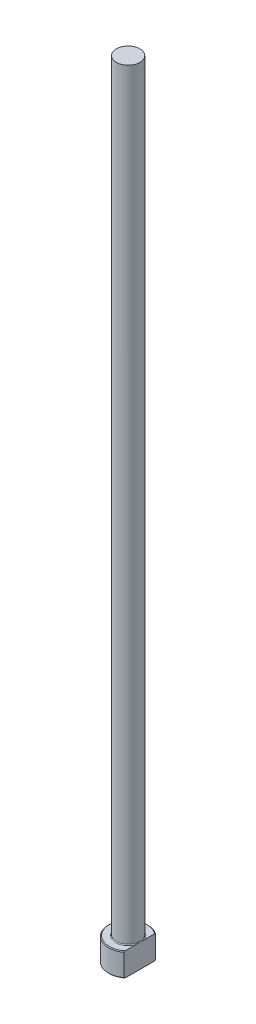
ISO-10303-21;
HEADER;
FILE_DESCRIPTION(('STEP AP214'),'2;1');
FILE_NAME('part.step','',(''),(''),'','','');
FILE_SCHEMA(('AUTOMOTIVE_DESIGN { 1 0 10303 214 1 1 1 1 }'));
ENDSEC;
DATA;
#1=APPLICATION_CONTEXT('core data for automotive mechanical design processes');
#2=APPLICATION_PROTOCOL_DEFINITION('international standard','automotive_design',2000,#1);
#3=PRODUCT_CONTEXT('',#1,'mechanical');
#4=PRODUCT('Part','Part','',(#3));
#5=PRODUCT_RELATED_PRODUCT_CATEGORY('part','',(#4));
#6=PRODUCT_DEFINITION_FORMATION('','',#4);
#7=PRODUCT_DEFINITION_CONTEXT('part definition',#1,'design');
#8=PRODUCT_DEFINITION('design','',#6,#7);
#9=PRODUCT_DEFINITION_SHAPE('','',#8);
#10=(LENGTH_UNIT() NAMED_UNIT(*) SI_UNIT(.MILLI.,.METRE.));
#11=(NAMED_UNIT(*) PLANE_ANGLE_UNIT() SI_UNIT($,.RADIAN.));
#12=(NAMED_UNIT(*) SI_UNIT($,.STERADIAN.) SOLID_ANGLE_UNIT());
#13=UNCERTAINTY_MEASURE_WITH_UNIT(LENGTH_MEASURE(1.E-05),#10,'distance_accuracy_value','');
#14=(GEOMETRIC_REPRESENTATION_CONTEXT(3) GLOBAL_UNCERTAINTY_ASSIGNED_CONTEXT((#13)) GLOBAL_UNIT_ASSIGNED_CONTEXT((#10,
#11,#12)) REPRESENTATION_CONTEXT('',''));
#15=CARTESIAN_POINT('',(0.,0.,0.));
#16=DIRECTION('',(0.,0.,1.));
#17=DIRECTION('',(1.,0.,0.));
#18=AXIS2_PLACEMENT_3D('',#15,#16,#17);
#19=CARTESIAN_POINT('',(0.,0.,0.));
#20=DIRECTION('',(0.,-1.,0.));
#21=DIRECTION('',(0.,0.,-1.));
#22=AXIS2_PLACEMENT_3D('',#19,#20,#21);
#23=PLANE('',#22);
#24=CARTESIAN_POINT('',(0.,0.,0.));
#25=DIRECTION('',(0.,-1.,0.));
#26=DIRECTION('',(0.,0.,-1.));
#27=AXIS2_PLACEMENT_3D('',#24,#25,#26);
#28=CIRCLE('',#27,4.79999999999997);
#29=CARTESIAN_POINT('',(2.99999999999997,0.,3.74699879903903));
#30=VERTEX_POINT('',#29);
#31=CARTESIAN_POINT('',(2.99999999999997,0.,-3.74699879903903));
#32=VERTEX_POINT('',#31);
#33=EDGE_CURVE('E98',#30,#32,#28,.T.);
#34=ORIENTED_EDGE('',*,*,#33,.T.);
#35=DIRECTION('',(0.,0.,1.));
#36=VECTOR('',#35,1.);
#37=CARTESIAN_POINT('',(2.99999999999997,0.,3.99999999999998));
#38=LINE('',#37,#36);
#39=EDGE_CURVE('E83',#32,#30,#38,.T.);
#40=ORIENTED_EDGE('',*,*,#39,.T.);
#41=EDGE_LOOP('',(#34,#40));
#42=FACE_BOUND('',#41,.T.);
#43=ADVANCED_FACE('F32',(#42),#23,.T.);
#44=CARTESIAN_POINT('',(0.,259.958771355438,0.));
#45=DIRECTION('',(0.,1.,0.));
#46=DIRECTION('',(0.,0.,1.));
#47=AXIS2_PLACEMENT_3D('',#44,#45,#46);
#48=CYLINDRICAL_SURFACE('',#47,4.99999999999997);
#49=CARTESIAN_POINT('',(0.,5.79999999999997,0.));
#50=DIRECTION('',(0.,1.,0.));
#51=DIRECTION('',(0.,0.,1.));
#52=AXIS2_PLACEMENT_3D('',#49,#50,#51);
#53=CIRCLE('',#52,4.99999999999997);
#54=CARTESIAN_POINT('',(2.99999999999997,5.79999999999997,3.99999999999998));
#55=VERTEX_POINT('',#54);
#56=CARTESIAN_POINT('',(2.99999999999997,5.79999999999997,-3.99999999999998));
#57=VERTEX_POINT('',#56);
#58=EDGE_CURVE('E104',#55,#57,#53,.F.);
#59=ORIENTED_EDGE('',*,*,#58,.T.);
#60=DIRECTION('',(0.,-1.,0.));
#61=VECTOR('',#60,1.);
#62=CARTESIAN_POINT('',(2.99999999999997,200.,-3.99999999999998));
#63=LINE('',#62,#61);
#64=CARTESIAN_POINT('',(2.99999999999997,0.200000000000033,-3.99999999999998));
#65=VERTEX_POINT('',#64);
#66=EDGE_CURVE('E183',#57,#65,#63,.T.);
#67=ORIENTED_EDGE('',*,*,#66,.T.);
#68=CARTESIAN_POINT('',(0.,0.200000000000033,0.));
#69=DIRECTION('',(0.,-1.,0.));
#70=DIRECTION('',(0.,0.,-1.));
#71=AXIS2_PLACEMENT_3D('',#68,#69,#70);
#72=CIRCLE('',#71,4.99999999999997);
#73=CARTESIAN_POINT('',(2.99999999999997,0.200000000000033,3.99999999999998));
#74=VERTEX_POINT('',#73);
#75=EDGE_CURVE('E100',#65,#74,#72,.F.);
#76=ORIENTED_EDGE('',*,*,#75,.T.);
#77=DIRECTION('',(0.,-1.,0.));
#78=VECTOR('',#77,1.);
#79=CARTESIAN_POINT('',(2.99999999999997,200.,3.99999999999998));
#80=LINE('',#79,#78);
#81=EDGE_CURVE('E93',#55,#74,#80,.T.);
#82=ORIENTED_EDGE('',*,*,#81,.F.);
#83=EDGE_LOOP('',(#59,#67,#76,#82));
#84=FACE_BOUND('',#83,.T.);
#85=ADVANCED_FACE('F158',(#84),#48,.T.);
#86=CARTESIAN_POINT('',(-4.99999999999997,6.,0.));
#87=DIRECTION('',(0.,1.,0.));
#88=DIRECTION('',(0.,0.,1.));
#89=AXIS2_PLACEMENT_3D('',#86,#87,#88);
#90=PLANE('',#89);
#91=CARTESIAN_POINT('',(0.,6.,0.));
#92=DIRECTION('',(0.,1.,0.));
#93=DIRECTION('',(0.,0.,1.));
#94=AXIS2_PLACEMENT_3D('',#91,#92,#93);
#95=CIRCLE('',#94,4.79999999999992);
#96=CARTESIAN_POINT('',(2.99999999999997,6.,-3.74699879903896));
#97=VERTEX_POINT('',#96);
#98=CARTESIAN_POINT('',(2.99999999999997,6.,3.74699879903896));
#99=VERTEX_POINT('',#98);
#100=EDGE_CURVE('E178',#97,#99,#95,.T.);
#101=ORIENTED_EDGE('',*,*,#100,.T.);
#102=DIRECTION('',(0.,0.,-1.));
#103=VECTOR('',#102,1.);
#104=CARTESIAN_POINT('',(2.99999999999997,6.,0.));
#105=LINE('',#104,#103);
#106=CARTESIAN_POINT('',(2.99999999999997,5.99999999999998,1.11355287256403));
#107=VERTEX_POINT('',#106);
#108=EDGE_CURVE('E57',#99,#107,#105,.T.);
#109=ORIENTED_EDGE('',*,*,#108,.T.);
#110=CARTESIAN_POINT('',(0.,6.,0.));
#111=DIRECTION('',(0.,1.,0.));
#112=DIRECTION('',(0.,0.,1.));
#113=AXIS2_PLACEMENT_3D('',#110,#111,#112);
#114=CIRCLE('',#113,3.19999999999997);
#115=CARTESIAN_POINT('',(2.99999999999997,5.99999999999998,-1.113552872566));
#116=VERTEX_POINT('',#115);
#117=EDGE_CURVE('E107',#107,#116,#114,.F.);
#118=ORIENTED_EDGE('',*,*,#117,.T.);
#119=EDGE_CURVE('E136',#116,#97,#105,.T.);
#120=ORIENTED_EDGE('',*,*,#119,.T.);
#121=EDGE_LOOP('',(#101,#109,#118,#120));
#122=FACE_BOUND('',#121,.T.);
#123=ADVANCED_FACE('F147',(#122),#90,.T.);
#124=CARTESIAN_POINT('',(0.,6.00000000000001,0.));
#125=DIRECTION('',(0.,-1.,0.));
#126=DIRECTION('',(0.,0.,-1.));
#127=AXIS2_PLACEMENT_3D('',#124,#125,#126);
#128=CONICAL_SURFACE('',#127,4.79999999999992,0.785398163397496);
#129=ORIENTED_EDGE('',*,*,#58,.F.);
#130=CARTESIAN_POINT('',(2.99999999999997,1.50107969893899,8.80169976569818));
#131=CARTESIAN_POINT('',(2.99999999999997,1.63686222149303,8.65824370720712));
#132=CARTESIAN_POINT('',(2.99999999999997,1.77246571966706,8.51461803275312));
#133=CARTESIAN_POINT('',(2.99999999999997,2.04325136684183,8.22696847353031));
#134=CARTESIAN_POINT('',(2.99999999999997,2.17843351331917,8.0829445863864));
#135=CARTESIAN_POINT('',(2.99999999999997,2.58356488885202,7.6498536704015));
#136=CARTESIAN_POINT('',(2.99999999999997,2.85278243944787,7.3601013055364));
#137=CARTESIAN_POINT('',(2.99999999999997,3.40003551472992,6.76562093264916));
#138=CARTESIAN_POINT('',(2.99999999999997,3.67795327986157,6.4607841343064));
#139=CARTESIAN_POINT('',(2.99999999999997,4.09143431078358,6.00077575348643));
#140=CARTESIAN_POINT('',(2.99999999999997,4.22862197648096,5.84706478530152));
#141=CARTESIAN_POINT('',(2.99999999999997,4.50164803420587,5.5384501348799));
#142=CARTESIAN_POINT('',(2.99999999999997,4.6374864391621,5.38354646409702));
#143=CARTESIAN_POINT('',(2.99999999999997,4.90727601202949,5.07249257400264));
#144=CARTESIAN_POINT('',(2.99999999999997,5.04122961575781,4.91634447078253));
#145=CARTESIAN_POINT('',(2.99999999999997,5.30697993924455,4.60220522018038));
#146=CARTESIAN_POINT('',(2.99999999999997,5.43877654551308,4.44421397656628));
#147=CARTESIAN_POINT('',(2.99999999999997,5.69999683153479,4.12534042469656));
#148=CARTESIAN_POINT('',(2.99999999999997,5.82941047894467,3.96444987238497));
#149=CARTESIAN_POINT('',(2.99999999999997,6.08438250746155,3.63966784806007));
#150=CARTESIAN_POINT('',(2.99999999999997,6.20994148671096,3.4757768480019));
#151=CARTESIAN_POINT('',(2.99999999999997,6.45325581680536,3.1473981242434));
#152=CARTESIAN_POINT('',(2.99999999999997,6.57111776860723,2.9829898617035));
#153=CARTESIAN_POINT('',(2.99999999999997,6.79968625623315,2.64903166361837));
#154=CARTESIAN_POINT('',(2.99999999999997,6.91038738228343,2.47947797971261));
#155=CARTESIAN_POINT('',(2.99999999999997,7.12046597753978,2.13484547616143));
#156=CARTESIAN_POINT('',(2.99999999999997,7.21990868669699,1.95980688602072));
#157=CARTESIAN_POINT('',(2.99999999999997,7.40271732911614,1.60161809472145));
#158=CARTESIAN_POINT('',(2.99999999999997,7.48611382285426,1.41848414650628));
#159=CARTESIAN_POINT('',(2.99999999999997,7.59087391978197,1.14242184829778));
#160=CARTESIAN_POINT('',(2.99999999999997,7.62169870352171,1.05308812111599));
#161=CARTESIAN_POINT('',(2.99999999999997,7.67691431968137,0.872393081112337));
#162=CARTESIAN_POINT('',(2.99999999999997,7.70130307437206,0.781031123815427));
#163=CARTESIAN_POINT('',(2.99999999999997,7.74245942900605,0.597105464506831));
#164=CARTESIAN_POINT('',(2.99999999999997,7.75926776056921,0.504551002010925));
#165=CARTESIAN_POINT('',(2.99999999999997,7.78456917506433,0.318316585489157));
#166=CARTESIAN_POINT('',(2.99999999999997,7.79306431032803,0.224636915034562));
#167=CARTESIAN_POINT('',(2.99999999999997,7.80126723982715,0.0362345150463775));
#168=CARTESIAN_POINT('',(2.99999999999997,7.80091364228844,-0.0584909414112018));
#169=CARTESIAN_POINT('',(2.99999999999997,7.7912899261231,-0.247479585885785));
#170=CARTESIAN_POINT('',(2.99999999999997,7.78201974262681,-0.341742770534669));
#171=CARTESIAN_POINT('',(2.99999999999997,7.75505711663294,-0.529484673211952));
#172=CARTESIAN_POINT('',(2.99999999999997,7.73732579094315,-0.622957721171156));
#173=CARTESIAN_POINT('',(2.99999999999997,7.69436193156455,-0.808152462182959));
#174=CARTESIAN_POINT('',(2.99999999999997,7.66912783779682,-0.899873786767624));
#175=CARTESIAN_POINT('',(2.99999999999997,7.59536615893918,-1.13513447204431));
#176=CARTESIAN_POINT('',(2.99999999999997,7.54190202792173,-1.27712290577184));
#177=CARTESIAN_POINT('',(2.99999999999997,7.42288064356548,-1.55591594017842));
#178=CARTESIAN_POINT('',(2.99999999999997,7.35731341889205,-1.69271615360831));
#179=CARTESIAN_POINT('',(2.99999999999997,7.21673004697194,-1.96297343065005));
#180=CARTESIAN_POINT('',(2.99999999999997,7.14163008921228,-2.09638641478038));
#181=CARTESIAN_POINT('',(2.99999999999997,7.0240988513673,-2.29351148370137));
#182=CARTESIAN_POINT('',(2.99999999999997,6.98411579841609,-2.35870939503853));
#183=CARTESIAN_POINT('',(2.99999999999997,6.90273519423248,-2.48821412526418));
#184=CARTESIAN_POINT('',(2.99999999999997,6.86133769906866,-2.55252097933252));
#185=CARTESIAN_POINT('',(2.99999999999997,6.72108058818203,-2.7659208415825));
#186=CARTESIAN_POINT('',(2.99999999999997,6.61950942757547,-2.91323263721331));
#187=CARTESIAN_POINT('',(2.99999999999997,6.41158682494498,-3.20445576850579));
#188=CARTESIAN_POINT('',(2.99999999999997,6.3052343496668,-3.3483663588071));
#189=CARTESIAN_POINT('',(2.99999999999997,6.08891481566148,-3.63358820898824));
#190=CARTESIAN_POINT('',(2.99999999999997,5.97894537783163,-3.77489765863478));
#191=CARTESIAN_POINT('',(2.99999999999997,5.75630759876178,-4.05537908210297));
#192=CARTESIAN_POINT('',(2.99999999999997,5.64363910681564,-4.19455093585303));
#193=CARTESIAN_POINT('',(2.99999999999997,5.41585487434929,-4.47160548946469));
#194=CARTESIAN_POINT('',(2.99999999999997,5.30073257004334,-4.6094827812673));
#195=CARTESIAN_POINT('',(2.99999999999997,5.06881951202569,-4.88382857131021));
#196=CARTESIAN_POINT('',(2.99999999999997,4.95202872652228,-5.02029704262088));
#197=CARTESIAN_POINT('',(2.99999999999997,4.59976429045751,-5.42786401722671));
#198=CARTESIAN_POINT('',(2.99999999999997,4.36230070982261,-5.69724186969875));
#199=CARTESIAN_POINT('',(2.99999999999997,3.90791057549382,-6.20584337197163));
#200=CARTESIAN_POINT('',(2.99999999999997,3.69132371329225,-6.4453721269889));
#201=CARTESIAN_POINT('',(2.99999999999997,3.2560075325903,-6.92252604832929));
#202=CARTESIAN_POINT('',(2.99999999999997,3.03727796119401,-7.16015098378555));
#203=CARTESIAN_POINT('',(2.99999999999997,2.59963438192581,-7.63242038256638));
#204=CARTESIAN_POINT('',(2.99999999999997,2.38073043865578,-7.86707418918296));
#205=CARTESIAN_POINT('',(2.99999999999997,1.9417265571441,-8.33519393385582));
#206=CARTESIAN_POINT('',(2.99999999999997,1.7216268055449,-8.56866004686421));
#207=CARTESIAN_POINT('',(2.99999999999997,1.50107969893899,-8.80169976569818));
#208=B_SPLINE_CURVE_WITH_KNOTS('',3,(#130,#131,#132,#133,#134,#135,#136,#137,#138,#139,#140,
#141,#142,#143,#144,#145,#146,#147,#148,#149,#150,#151,#152,#153,#154,#155,#156,#157,#158,#159,
#160,#161,#162,#163,#164,#165,#166,#167,#168,#169,#170,#171,#172,#173,#174,#175,#176,#177,#178,
#179,#180,#181,#182,#183,#184,#185,#186,#187,#188,#189,#190,#191,#192,#193,#194,#195,#196,#197,
#198,#199,#200,#201,#202,#203,#204,#205,#206,#207),.UNSPECIFIED.,.F.,.F.,(4,2,2,2,2,2,2,2,2,2,2,
2,2,2,2,2,2,2,2,2,2,2,2,2,2,2,2,2,2,2,2,2,2,2,2,2,2,2,4),(0.,0.5925780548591,1.18515965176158,
2.37170329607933,3.60919781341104,4.22727570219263,4.84534766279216,5.46252965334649,
6.07974401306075,6.69913968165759,7.31843874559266,7.92518229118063,8.5323789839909,
9.135854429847,9.73816890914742,10.0214813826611,10.3048852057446,10.5867475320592,
10.8685402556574,11.152288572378,11.436038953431,11.7211060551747,12.0062324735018,
12.4605654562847,12.9152744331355,13.3743011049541,13.6037325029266,13.8331548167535,
14.3698070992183,14.9065759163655,15.4437051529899,15.9808644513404,16.5197074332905,
17.0585606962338,18.1358079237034,19.1045853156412,20.0734784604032,21.0361950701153,
21.9987655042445),.UNSPECIFIED.);
#209=EDGE_CURVE('E135',#55,#99,#208,.T.);
#210=ORIENTED_EDGE('',*,*,#209,.T.);
#211=ORIENTED_EDGE('',*,*,#100,.F.);
#212=EDGE_CURVE('E127',#97,#57,#208,.T.);
#213=ORIENTED_EDGE('',*,*,#212,.T.);
#214=EDGE_LOOP('',(#129,#210,#211,#213));
#215=FACE_BOUND('',#214,.T.);
#216=ADVANCED_FACE('F143',(#215),#128,.T.);
#217=CARTESIAN_POINT('',(0.,0.200000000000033,0.));
#218=DIRECTION('',(0.,1.,0.));
#219=DIRECTION('',(0.,0.,1.));
#220=AXIS2_PLACEMENT_3D('',#217,#218,#219);
#221=CONICAL_SURFACE('',#220,4.99999999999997,0.785398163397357);
#222=ORIENTED_EDGE('',*,*,#75,.F.);
#223=CARTESIAN_POINT('',(2.99999999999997,4.49892030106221,-8.80169976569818));
#224=CARTESIAN_POINT('',(2.99999999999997,4.36313777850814,-8.65824370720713));
#225=CARTESIAN_POINT('',(2.99999999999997,4.22753428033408,-8.51461803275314));
#226=CARTESIAN_POINT('',(2.99999999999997,3.95674863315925,-8.22696847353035));
#227=CARTESIAN_POINT('',(2.99999999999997,3.82156648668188,-8.08294458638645));
#228=CARTESIAN_POINT('',(2.99999999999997,3.41643511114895,-7.64985367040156));
#229=CARTESIAN_POINT('',(2.99999999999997,3.14721756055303,-7.36010130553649));
#230=CARTESIAN_POINT('',(2.99999999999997,2.59996448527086,-6.76562093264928));
#231=CARTESIAN_POINT('',(2.99999999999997,2.32204672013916,-6.46078413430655));
#232=CARTESIAN_POINT('',(2.99999999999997,1.90856568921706,-6.0007757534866));
#233=CARTESIAN_POINT('',(2.99999999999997,1.77137802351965,-5.84706478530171));
#234=CARTESIAN_POINT('',(2.99999999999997,1.49835196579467,-5.5384501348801));
#235=CARTESIAN_POINT('',(2.99999999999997,1.36251356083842,-5.38354646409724));
#236=CARTESIAN_POINT('',(2.99999999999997,1.09272398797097,-5.07249257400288));
#237=CARTESIAN_POINT('',(2.99999999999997,0.958770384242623,-4.91634447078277));
#238=CARTESIAN_POINT('',(2.99999999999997,0.693020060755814,-4.60220522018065));
#239=CARTESIAN_POINT('',(2.99999999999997,0.561223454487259,-4.44421397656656));
#240=CARTESIAN_POINT('',(2.99999999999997,0.300003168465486,-4.12534042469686));
#241=CARTESIAN_POINT('',(2.99999999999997,0.170589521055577,-3.96444987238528));
#242=CARTESIAN_POINT('',(2.99999999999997,-0.0843825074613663,-3.63966784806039));
#243=CARTESIAN_POINT('',(2.99999999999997,-0.209941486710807,-3.47577684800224));
#244=CARTESIAN_POINT('',(2.99999999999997,-0.45325581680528,-3.14739812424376));
#245=CARTESIAN_POINT('',(2.99999999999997,-0.57111776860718,-2.98298986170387));
#246=CARTESIAN_POINT('',(2.99999999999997,-0.799686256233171,-2.64903166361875));
#247=CARTESIAN_POINT('',(2.99999999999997,-0.910387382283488,-2.479477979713));
#248=CARTESIAN_POINT('',(2.99999999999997,-1.12046597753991,-2.13484547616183));
#249=CARTESIAN_POINT('',(2.99999999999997,-1.21990868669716,-1.95980688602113));
#250=CARTESIAN_POINT('',(2.99999999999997,-1.40271732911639,-1.60161809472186));
#251=CARTESIAN_POINT('',(2.99999999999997,-1.48611382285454,-1.4184841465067));
#252=CARTESIAN_POINT('',(2.99999999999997,-1.5908739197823,-1.14242184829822));
#253=CARTESIAN_POINT('',(2.99999999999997,-1.62169870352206,-1.05308812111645));
#254=CARTESIAN_POINT('',(2.99999999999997,-1.67691431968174,-0.872393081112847));
#255=CARTESIAN_POINT('',(2.99999999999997,-1.70130307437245,-0.781031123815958));
#256=CARTESIAN_POINT('',(2.99999999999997,-1.74245942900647,-0.597105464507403));
#257=CARTESIAN_POINT('',(2.99999999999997,-1.75926776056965,-0.504551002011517));
#258=CARTESIAN_POINT('',(2.99999999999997,-1.78456917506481,-0.318316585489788));
#259=CARTESIAN_POINT('',(2.99999999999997,-1.79306431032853,-0.224636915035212));
#260=CARTESIAN_POINT('',(2.99999999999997,-1.80126723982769,-0.0362345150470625));
#261=CARTESIAN_POINT('',(2.99999999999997,-1.800913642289,0.0584909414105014));
#262=CARTESIAN_POINT('',(2.99999999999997,-1.79128992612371,0.247479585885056));
#263=CARTESIAN_POINT('',(2.99999999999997,-1.78201974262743,0.341742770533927));
#264=CARTESIAN_POINT('',(2.99999999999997,-1.75505711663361,0.529484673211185));
#265=CARTESIAN_POINT('',(2.99999999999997,-1.73732579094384,0.622957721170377));
#266=CARTESIAN_POINT('',(2.99999999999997,-1.69436193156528,0.808152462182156));
#267=CARTESIAN_POINT('',(2.99999999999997,-1.66912783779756,0.899873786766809));
#268=CARTESIAN_POINT('',(2.99999999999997,-1.59536615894,1.13513447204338));
#269=CARTESIAN_POINT('',(2.99999999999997,-1.54190202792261,1.2771229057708));
#270=CARTESIAN_POINT('',(2.99999999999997,-1.42288064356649,1.55591594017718));
#271=CARTESIAN_POINT('',(2.99999999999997,-1.35731341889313,1.69271615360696));
#272=CARTESIAN_POINT('',(2.99999999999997,-1.21673004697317,1.9629734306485));
#273=CARTESIAN_POINT('',(2.99999999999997,-1.14163008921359,2.09638641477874));
#274=CARTESIAN_POINT('',(2.99999999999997,-1.02409885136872,2.29351148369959));
#275=CARTESIAN_POINT('',(2.99999999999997,-0.984115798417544,2.3587093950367));
#276=CARTESIAN_POINT('',(2.99999999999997,-0.902735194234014,2.48821412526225));
#277=CARTESIAN_POINT('',(2.99999999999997,-0.861337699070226,2.55252097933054));
#278=CARTESIAN_POINT('',(2.99999999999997,-0.721080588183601,2.76592084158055));
#279=CARTESIAN_POINT('',(2.99999999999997,-0.619509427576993,2.91323263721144));
#280=CARTESIAN_POINT('',(2.99999999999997,-0.411586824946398,3.20445576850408));
#281=CARTESIAN_POINT('',(2.99999999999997,-0.305234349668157,3.34836635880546));
#282=CARTESIAN_POINT('',(2.99999999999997,-0.0889148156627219,3.63358820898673));
#283=CARTESIAN_POINT('',(2.99999999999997,0.0210546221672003,3.77489765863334));
#284=CARTESIAN_POINT('',(2.99999999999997,0.243692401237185,4.05537908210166));
#285=CARTESIAN_POINT('',(2.99999999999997,0.356360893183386,4.19455093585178));
#286=CARTESIAN_POINT('',(2.99999999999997,0.58414512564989,4.47160548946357));
#287=CARTESIAN_POINT('',(2.99999999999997,0.699267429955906,4.60948278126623));
#288=CARTESIAN_POINT('',(2.99999999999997,0.93118048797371,4.88382857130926));
#289=CARTESIAN_POINT('',(2.99999999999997,1.0479712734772,5.02029704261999));
#290=CARTESIAN_POINT('',(2.99999999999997,1.4002357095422,5.42786401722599));
#291=CARTESIAN_POINT('',(2.99999999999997,1.63769929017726,5.69724186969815));
#292=CARTESIAN_POINT('',(2.99999999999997,2.09208942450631,6.20584337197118));
#293=CARTESIAN_POINT('',(2.99999999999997,2.30867628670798,6.4453721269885));
#294=CARTESIAN_POINT('',(2.99999999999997,2.74399246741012,6.92252604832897));
#295=CARTESIAN_POINT('',(2.99999999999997,2.96272203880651,7.16015098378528));
#296=CARTESIAN_POINT('',(2.99999999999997,3.40036561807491,7.63242038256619));
#297=CARTESIAN_POINT('',(2.99999999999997,3.61926956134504,7.86707418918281));
#298=CARTESIAN_POINT('',(2.99999999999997,4.05827344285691,8.33519393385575));
#299=CARTESIAN_POINT('',(2.99999999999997,4.27837319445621,8.56866004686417));
#300=CARTESIAN_POINT('',(2.99999999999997,4.49892030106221,8.80169976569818));
#301=B_SPLINE_CURVE_WITH_KNOTS('',3,(#223,#224,#225,#226,#227,#228,#229,#230,#231,#232,#233,
#234,#235,#236,#237,#238,#239,#240,#241,#242,#243,#244,#245,#246,#247,#248,#249,#250,#251,#252,
#253,#254,#255,#256,#257,#258,#259,#260,#261,#262,#263,#264,#265,#266,#267,#268,#269,#270,#271,
#272,#273,#274,#275,#276,#277,#278,#279,#280,#281,#282,#283,#284,#285,#286,#287,#288,#289,#290,
#291,#292,#293,#294,#295,#296,#297,#298,#299,#300),.UNSPECIFIED.,.F.,.F.,(4,2,2,2,2,2,2,2,2,2,2,
2,2,2,2,2,2,2,2,2,2,2,2,2,2,2,2,2,2,2,2,2,2,2,2,2,2,2,4),(0.,0.592578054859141,1.18515965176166,
2.3717032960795,3.60919781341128,4.22727570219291,4.84534766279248,5.46252965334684,
6.07974401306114,6.69913968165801,7.31843874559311,7.92518229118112,8.53237898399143,
9.13585442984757,9.73816890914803,10.0214813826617,10.3048852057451,10.5867475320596,
10.8685402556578,11.1522885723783,11.4360389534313,11.721106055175,12.006232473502,
12.4605654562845,12.915274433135,13.3743011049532,13.6037325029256,13.8331548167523,
14.3698070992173,14.9065759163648,15.4437051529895,15.9808644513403,16.5197074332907,
17.0585606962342,18.1358079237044,19.1045853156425,20.0734784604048,21.0361950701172,
21.9987655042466),.UNSPECIFIED.);
#302=EDGE_CURVE('E86',#65,#32,#301,.T.);
#303=ORIENTED_EDGE('',*,*,#302,.T.);
#304=ORIENTED_EDGE('',*,*,#33,.F.);
#305=EDGE_CURVE('E89',#30,#74,#301,.T.);
#306=ORIENTED_EDGE('',*,*,#305,.T.);
#307=EDGE_LOOP('',(#222,#303,#304,#306));
#308=FACE_BOUND('',#307,.T.);
#309=ADVANCED_FACE('F97',(#308),#221,.T.);
#310=CARTESIAN_POINT('',(0.,6.19999999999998,0.));
#311=DIRECTION('',(0.,1.,0.));
#312=DIRECTION('',(0.,0.,1.));
#313=AXIS2_PLACEMENT_3D('',#310,#311,#312);
#314=TOROIDAL_SURFACE('',#313,3.19999999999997,0.2);
#315=CARTESIAN_POINT('',(2.99999999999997,6.19999999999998,0.));
#316=CARTESIAN_POINT('',(2.99999999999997,6.20000054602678,-8.25590029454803E-09));
#317=CARTESIAN_POINT('',(2.99999999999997,6.20000108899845,-2.22623717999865E-07));
#318=CARTESIAN_POINT('',(2.99999999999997,6.20000210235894,-8.13181332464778E-07));
#319=CARTESIAN_POINT('',(2.99999999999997,6.20000256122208,-1.20262210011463E-06));
#320=CARTESIAN_POINT('',(2.99999999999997,6.20000351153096,-2.13233194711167E-06));
#321=CARTESIAN_POINT('',(2.99999999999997,6.20000398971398,-2.68711080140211E-06));
#322=CARTESIAN_POINT('',(2.99999999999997,6.20000484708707,-3.8372299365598E-06));
#323=CARTESIAN_POINT('',(2.99999999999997,6.20000522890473,-4.43075975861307E-06));
#324=CARTESIAN_POINT('',(2.99999999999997,6.20000663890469,-6.718054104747E-06));
#325=CARTESIAN_POINT('',(2.99999999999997,6.20000758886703,-8.46267334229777E-06));
#326=CARTESIAN_POINT('',(2.99999999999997,6.20000915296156,-1.19195939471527E-05));
#327=CARTESIAN_POINT('',(2.99999999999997,6.20000978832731,-1.36226968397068E-05));
#328=CARTESIAN_POINT('',(2.99999999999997,6.20001243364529,-2.07785329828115E-05));
#329=CARTESIAN_POINT('',(2.99999999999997,6.20001439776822,-2.62512689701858E-05));
#330=CARTESIAN_POINT('',(2.99999999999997,6.20001730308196,-3.65971254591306E-05));
#331=CARTESIAN_POINT('',(2.99999999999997,6.20001835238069,-4.14397204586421E-05));
#332=CARTESIAN_POINT('',(2.99999999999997,6.20002589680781,-7.68826112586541E-05));
#333=CARTESIAN_POINT('',(2.99999999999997,6.20003169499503,-0.000107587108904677));
#334=CARTESIAN_POINT('',(2.99999999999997,6.20005649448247,-0.000225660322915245));
#335=CARTESIAN_POINT('',(2.99999999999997,6.20007997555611,-0.000312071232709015));
#336=CARTESIAN_POINT('',(2.99999999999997,6.20016717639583,-0.00063874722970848));
#337=CARTESIAN_POINT('',(2.99999999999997,6.20022823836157,-0.00087949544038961));
#338=CARTESIAN_POINT('',(2.99999999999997,6.20046253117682,-0.00179757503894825));
#339=CARTESIAN_POINT('',(2.99999999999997,6.20063826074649,-0.00247448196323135));
#340=CARTESIAN_POINT('',(2.99999999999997,6.20145771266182,-0.00563611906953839));
#341=CARTESIAN_POINT('',(2.99999999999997,6.20209802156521,-0.00812138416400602));
#342=CARTESIAN_POINT('',(2.99999999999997,6.20747052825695,-0.0289666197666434));
#343=CARTESIAN_POINT('',(2.99999999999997,6.21221441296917,-0.0473249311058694));
#344=CARTESIAN_POINT('',(2.99999999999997,6.22150414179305,-0.0833908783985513));
#345=CARTESIAN_POINT('',(2.99999999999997,6.22605099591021,-0.101098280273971));
#346=CARTESIAN_POINT('',(2.99999999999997,6.24071513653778,-0.158441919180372));
#347=CARTESIAN_POINT('',(2.99999999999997,6.25076238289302,-0.198096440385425));
#348=CARTESIAN_POINT('',(2.99999999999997,6.2673587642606,-0.264903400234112));
#349=CARTESIAN_POINT('',(2.99999999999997,6.27400650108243,-0.292031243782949));
#350=CARTESIAN_POINT('',(2.99999999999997,6.28691139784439,-0.345693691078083));
#351=CARTESIAN_POINT('',(2.99999999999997,6.2931740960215,-0.372226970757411));
#352=CARTESIAN_POINT('',(2.99999999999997,6.31359314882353,-0.460847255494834));
#353=CARTESIAN_POINT('',(2.99999999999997,6.32711949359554,-0.523084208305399));
#354=CARTESIAN_POINT('',(2.99999999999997,6.35185224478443,-0.648627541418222));
#355=CARTESIAN_POINT('',(2.99999999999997,6.36303576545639,-0.711938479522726));
#356=CARTESIAN_POINT('',(2.99999999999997,6.38269719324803,-0.845442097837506));
#357=CARTESIAN_POINT('',(2.99999999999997,6.39079783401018,-0.915695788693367));
#358=CARTESIAN_POINT('',(2.99999999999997,6.39788104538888,-1.02128246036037));
#359=CARTESIAN_POINT('',(2.99999999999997,6.39939945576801,-1.05644278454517));
#360=CARTESIAN_POINT('',(2.99999999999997,6.40031405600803,-1.12678521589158));
#361=CARTESIAN_POINT('',(2.99999999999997,6.39971158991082,-1.16196729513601));
#362=CARTESIAN_POINT('',(2.99999999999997,6.39660553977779,-1.21713951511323));
#363=CARTESIAN_POINT('',(2.99999999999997,6.39502683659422,-1.23718181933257));
#364=CARTESIAN_POINT('',(2.99999999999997,6.39080008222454,-1.27717351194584));
#365=CARTESIAN_POINT('',(2.99999999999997,6.38815120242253,-1.29712281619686));
#366=CARTESIAN_POINT('',(2.99999999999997,6.38160570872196,-1.33655702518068));
#367=CARTESIAN_POINT('',(2.99999999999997,6.37772556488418,-1.35604460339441));
#368=CARTESIAN_POINT('',(2.99999999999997,6.36841119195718,-1.39463554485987));
#369=CARTESIAN_POINT('',(2.99999999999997,6.36297874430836,-1.41373932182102));
#370=CARTESIAN_POINT('',(2.99999999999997,6.3500393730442,-1.45151809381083));
#371=CARTESIAN_POINT('',(2.99999999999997,6.34250654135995,-1.4701843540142));
#372=CARTESIAN_POINT('',(2.99999999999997,6.32469433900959,-1.50617232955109));
#373=CARTESIAN_POINT('',(2.99999999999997,6.31442814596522,-1.52349999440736));
#374=CARTESIAN_POINT('',(2.99999999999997,6.29768486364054,-1.5453003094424));
#375=CARTESIAN_POINT('',(2.99999999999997,6.29285641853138,-1.551032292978));
#376=CARTESIAN_POINT('',(2.99999999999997,6.28257691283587,-1.56192749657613));
#377=CARTESIAN_POINT('',(2.99999999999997,6.27712536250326,-1.56709026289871));
#378=CARTESIAN_POINT('',(2.99999999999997,6.26548354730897,-1.57666725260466));
#379=CARTESIAN_POINT('',(2.99999999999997,6.25928560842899,-1.58107232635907));
#380=CARTESIAN_POINT('',(2.99999999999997,6.24620912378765,-1.5887219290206));
#381=CARTESIAN_POINT('',(2.99999999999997,6.23933242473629,-1.59196950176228));
#382=CARTESIAN_POINT('',(2.99999999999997,6.2270240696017,-1.5962468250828));
#383=CARTESIAN_POINT('',(2.99999999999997,6.2217197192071,-1.59764171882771));
#384=CARTESIAN_POINT('',(2.99999999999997,6.2109516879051,-1.59951721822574));
#385=CARTESIAN_POINT('',(2.99999999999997,6.20548813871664,-1.59999855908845));
#386=CARTESIAN_POINT('',(2.99999999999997,6.19455397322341,-1.60000143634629));
#387=CARTESIAN_POINT('',(2.99999999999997,6.18908335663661,-1.59952177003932));
#388=CARTESIAN_POINT('',(2.99999999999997,6.17830149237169,-1.59764696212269));
#389=CARTESIAN_POINT('',(2.99999999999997,6.17299036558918,-1.59625114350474));
#390=CARTESIAN_POINT('',(2.99999999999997,6.16137413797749,-1.5922159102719));
#391=CARTESIAN_POINT('',(2.99999999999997,6.15514663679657,-1.58935479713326));
#392=CARTESIAN_POINT('',(2.99999999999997,6.14323789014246,-1.58266473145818));
#393=CARTESIAN_POINT('',(2.99999999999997,6.13755768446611,-1.57883398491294));
#394=CARTESIAN_POINT('',(2.99999999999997,6.12388989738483,-1.5682309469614));
#395=CARTESIAN_POINT('',(2.99999999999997,6.11627920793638,-1.5609769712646));
#396=CARTESIAN_POINT('',(2.99999999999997,6.10222993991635,-1.54541986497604));
#397=CARTESIAN_POINT('',(2.99999999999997,6.09579438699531,-1.53711411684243));
#398=CARTESIAN_POINT('',(2.99999999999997,6.07874447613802,-1.51234359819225));
#399=CARTESIAN_POINT('',(2.99999999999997,6.06934681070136,-1.49505024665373));
#400=CARTESIAN_POINT('',(2.99999999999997,6.05300413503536,-1.45936637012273));
#401=CARTESIAN_POINT('',(2.99999999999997,6.04606563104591,-1.44097308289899));
#402=CARTESIAN_POINT('',(2.99999999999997,6.03343712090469,-1.40170303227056));
#403=CARTESIAN_POINT('',(2.99999999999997,6.02794514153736,-1.38076360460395));
#404=CARTESIAN_POINT('',(2.99999999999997,6.01869119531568,-1.33849708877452));
#405=CARTESIAN_POINT('',(2.99999999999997,6.01493126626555,-1.31716957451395));
#406=CARTESIAN_POINT('',(2.99999999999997,6.00879575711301,-1.27427301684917));
#407=CARTESIAN_POINT('',(2.99999999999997,6.0064232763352,-1.25270354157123));
#408=CARTESIAN_POINT('',(2.99999999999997,6.00283272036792,-1.2094871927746));
#409=CARTESIAN_POINT('',(2.99999999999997,6.00161392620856,-1.18784037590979));
#410=CARTESIAN_POINT('',(2.99999999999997,5.99921193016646,-1.11739576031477));
#411=CARTESIAN_POINT('',(2.99999999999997,5.99998309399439,-1.06853061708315));
#412=CARTESIAN_POINT('',(2.99999999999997,6.0049845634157,-0.970964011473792));
#413=CARTESIAN_POINT('',(2.99999999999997,6.00921876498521,-0.922262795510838));
#414=CARTESIAN_POINT('',(2.99999999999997,6.02027934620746,-0.825023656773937));
#415=CARTESIAN_POINT('',(2.99999999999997,6.02711306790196,-0.776486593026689));
#416=CARTESIAN_POINT('',(2.99999999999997,6.04272509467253,-0.679720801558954));
#417=CARTESIAN_POINT('',(2.99999999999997,6.05150395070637,-0.631492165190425));
#418=CARTESIAN_POINT('',(2.99999999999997,6.07999589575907,-0.487173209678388));
#419=CARTESIAN_POINT('',(2.99999999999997,6.10185558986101,-0.39151417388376));
#420=CARTESIAN_POINT('',(2.99999999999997,6.14819769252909,-0.200831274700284));
#421=CARTESIAN_POINT('',(2.99999999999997,6.17268119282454,-0.105807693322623));
#422=CARTESIAN_POINT('',(2.99999999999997,6.19722910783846,-0.01073189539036));
#423=CARTESIAN_POINT('',(2.99999999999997,6.1972452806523,-0.0106692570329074));
#424=CARTESIAN_POINT('',(2.99999999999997,6.19781243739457,-0.00847232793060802));
#425=CARTESIAN_POINT('',(2.99999999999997,6.19836102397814,-0.00633759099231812));
#426=CARTESIAN_POINT('',(2.99999999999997,6.19915976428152,-0.00325873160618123));
#427=CARTESIAN_POINT('',(2.99999999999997,6.19940591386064,-0.0023138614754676));
#428=CARTESIAN_POINT('',(2.99999999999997,6.19972567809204,-0.00105818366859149));
#429=CARTESIAN_POINT('',(2.99999999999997,6.1998040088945,-0.000748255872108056));
#430=CARTESIAN_POINT('',(2.99999999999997,6.19991224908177,-0.0003408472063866));
#431=CARTESIAN_POINT('',(2.99999999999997,6.19993871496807,-0.000242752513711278));
#432=CARTESIAN_POINT('',(2.99999999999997,6.1999662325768,-0.000111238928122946));
#433=CARTESIAN_POINT('',(2.99999999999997,6.19997237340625,-7.8903777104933E-05));
#434=CARTESIAN_POINT('',(2.99999999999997,6.19998062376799,-4.17973013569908E-05));
#435=CARTESIAN_POINT('',(2.99999999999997,6.1999817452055,-3.68646326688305E-05));
#436=CARTESIAN_POINT('',(2.99999999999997,6.19998486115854,-2.63337098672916E-05));
#437=CARTESIAN_POINT('',(2.99999999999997,6.19998697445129,-2.07707790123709E-05));
#438=CARTESIAN_POINT('',(2.99999999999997,6.19998981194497,-1.35213137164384E-05));
#439=CARTESIAN_POINT('',(2.99999999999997,6.19999048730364,-1.18115060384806E-05));
#440=CARTESIAN_POINT('',(2.99999999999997,6.19999214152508,-8.34771964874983E-06));
#441=CARTESIAN_POINT('',(2.99999999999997,6.19999314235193,-6.60378872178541E-06));
#442=CARTESIAN_POINT('',(2.99999999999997,6.19999462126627,-4.32501646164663E-06));
#443=CARTESIAN_POINT('',(2.99999999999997,6.19999502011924,-3.73587510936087E-06));
#444=CARTESIAN_POINT('',(2.99999999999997,6.19999591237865,-2.59760769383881E-06));
#445=CARTESIAN_POINT('',(2.99999999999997,6.19999640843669,-2.05040430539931E-06));
#446=CARTESIAN_POINT('',(2.99999999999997,6.19999738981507,-1.1384674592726E-06));
#447=CARTESIAN_POINT('',(2.99999999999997,6.1999978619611,-7.58552555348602E-07));
#448=CARTESIAN_POINT('',(2.99999999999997,6.19999889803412,-1.92079007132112E-07));
#449=CARTESIAN_POINT('',(2.99999999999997,6.19999945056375,8.30745072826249E-09));
#450=CARTESIAN_POINT('',(2.99999999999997,6.19999999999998,0.));
#451=B_SPLINE_CURVE_WITH_KNOTS('',3,(#315,#316,#317,#318,#319,#320,#321,#322,#323,#324,#325,
#326,#327,#328,#329,#330,#331,#332,#333,#334,#335,#336,#337,#338,#339,#340,#341,#342,#343,#344,
#345,#346,#347,#348,#349,#350,#351,#352,#353,#354,#355,#356,#357,#358,#359,#360,#361,#362,#363,
#364,#365,#366,#367,#368,#369,#370,#371,#372,#373,#374,#375,#376,#377,#378,#379,#380,#381,#382,
#383,#384,#385,#386,#387,#388,#389,#390,#391,#392,#393,#394,#395,#396,#397,#398,#399,#400,#401,
#402,#403,#404,#405,#406,#407,#408,#409,#410,#411,#412,#413,#414,#415,#416,#417,#418,#419,#420,
#421,#422,#423,#424,#425,#426,#427,#428,#429,#430,#431,#432,#433,#434,#435,#436,#437,#438,#439,
#440,#441,#442,#443,#444,#445,#446,#447,#448,#449,#450),.UNSPECIFIED.,.T.,.F.,(4,2,2,2,2,2,2,2,
2,2,2,2,2,2,2,2,2,2,2,2,2,2,2,2,2,2,2,2,2,2,2,2,2,2,2,2,2,2,2,2,2,2,2,2,2,2,2,2,2,2,2,2,2,2,2,2,
2,2,2,2,2,2,2,2,2,2,2,4),(0.,1.65204690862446E-06,3.45848791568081E-06,5.64280248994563E-06,
7.75882419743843E-06,1.36969709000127E-05,1.91454439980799E-05,3.65603921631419E-05,
5.14083081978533E-05,0.000145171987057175,0.00041354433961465,0.00115890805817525,
0.00325667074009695,0.0109563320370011,0.0678386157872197,0.12268455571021,0.245405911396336,
0.329196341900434,0.410983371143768,0.602016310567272,0.794836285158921,1.0067376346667,
1.11227258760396,1.21774067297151,1.27803175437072,1.33836960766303,1.39793215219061,
1.45742661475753,1.51769013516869,1.57766822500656,1.60011625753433,1.62258205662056,
1.64530254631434,1.66796284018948,1.68434680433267,1.70071757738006,1.71710885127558,
1.7335122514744,1.75395806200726,1.77444198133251,1.8058056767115,1.83724902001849,
1.89596356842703,1.95483231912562,2.01967230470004,2.08458838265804,2.14964892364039,
2.21466889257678,2.36107995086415,2.50765595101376,2.65464904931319,2.8016838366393,
3.09594779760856,3.39033467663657,3.39052875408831,3.39714155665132,3.40007033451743,
3.40102967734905,3.40133420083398,3.40143296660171,3.40144812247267,3.4014659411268,
3.40147145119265,3.40147746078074,3.40147959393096,3.40148179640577,3.40148361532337,
3.40148527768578),.UNSPECIFIED.);
#452=CARTESIAN_POINT('',(2.99999999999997,6.19999999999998,0.));
#453=VERTEX_POINT('',#452);
#454=EDGE_CURVE('E11',#116,#453,#451,.T.);
#455=ORIENTED_EDGE('',*,*,#454,.F.);
#456=ORIENTED_EDGE('',*,*,#117,.F.);
#457=CARTESIAN_POINT('',(2.99999999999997,6.19999999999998,0.));
#458=CARTESIAN_POINT('',(2.99999999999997,6.19999945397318,8.25590052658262E-09));
#459=CARTESIAN_POINT('',(2.99999999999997,6.19999891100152,2.22623718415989E-07));
#460=CARTESIAN_POINT('',(2.99999999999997,6.19999789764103,8.13181332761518E-07));
#461=CARTESIAN_POINT('',(2.99999999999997,6.19999743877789,1.2026221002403E-06));
#462=CARTESIAN_POINT('',(2.99999999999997,6.19999648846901,2.13233194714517E-06));
#463=CARTESIAN_POINT('',(2.99999999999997,6.19999601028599,2.68711080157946E-06));
#464=CARTESIAN_POINT('',(2.99999999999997,6.1999951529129,3.83722993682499E-06));
#465=CARTESIAN_POINT('',(2.99999999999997,6.19999477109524,4.43075975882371E-06));
#466=CARTESIAN_POINT('',(2.99999999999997,6.19999336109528,6.7180541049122E-06));
#467=CARTESIAN_POINT('',(2.99999999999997,6.19999241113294,8.4626733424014E-06));
#468=CARTESIAN_POINT('',(2.99999999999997,6.19999084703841,1.19195939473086E-05));
#469=CARTESIAN_POINT('',(2.99999999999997,6.19999021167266,1.36226968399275E-05));
#470=CARTESIAN_POINT('',(2.99999999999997,6.19998756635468,2.07785329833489E-05));
#471=CARTESIAN_POINT('',(2.99999999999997,6.19998560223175,2.62512689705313E-05));
#472=CARTESIAN_POINT('',(2.99999999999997,6.19998269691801,3.65971254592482E-05));
#473=CARTESIAN_POINT('',(2.99999999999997,6.19998164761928,4.14397204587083E-05));
#474=CARTESIAN_POINT('',(2.99999999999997,6.19997410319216,7.68826112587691E-05));
#475=CARTESIAN_POINT('',(2.99999999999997,6.19996830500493,0.000107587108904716));
#476=CARTESIAN_POINT('',(2.99999999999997,6.1999435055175,0.000225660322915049));
#477=CARTESIAN_POINT('',(2.99999999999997,6.19992002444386,0.000312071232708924));
#478=CARTESIAN_POINT('',(2.99999999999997,6.19983282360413,0.000638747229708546));
#479=CARTESIAN_POINT('',(2.99999999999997,6.1997717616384,0.000879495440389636));
#480=CARTESIAN_POINT('',(2.99999999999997,6.19953746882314,0.00179757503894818));
#481=CARTESIAN_POINT('',(2.99999999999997,6.19936173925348,0.00247448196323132));
#482=CARTESIAN_POINT('',(2.99999999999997,6.19854228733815,0.0056361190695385));
#483=CARTESIAN_POINT('',(2.99999999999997,6.19790197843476,0.00812138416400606));
#484=CARTESIAN_POINT('',(2.99999999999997,6.19252947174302,0.0289666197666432));
#485=CARTESIAN_POINT('',(2.99999999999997,6.1877855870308,0.0473249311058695));
#486=CARTESIAN_POINT('',(2.99999999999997,6.17849585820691,0.0833908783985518));
#487=CARTESIAN_POINT('',(2.99999999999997,6.17394900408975,0.101098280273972));
#488=CARTESIAN_POINT('',(2.99999999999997,6.15928486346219,0.158441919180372));
#489=CARTESIAN_POINT('',(2.99999999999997,6.14923761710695,0.198096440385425));
#490=CARTESIAN_POINT('',(2.99999999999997,6.13264123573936,0.264903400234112));
#491=CARTESIAN_POINT('',(2.99999999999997,6.12599349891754,0.292031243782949));
#492=CARTESIAN_POINT('',(2.99999999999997,6.11308860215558,0.345693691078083));
#493=CARTESIAN_POINT('',(2.99999999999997,6.10682590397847,0.372226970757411));
#494=CARTESIAN_POINT('',(2.99999999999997,6.08640685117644,0.460847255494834));
#495=CARTESIAN_POINT('',(2.99999999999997,6.07288050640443,0.523084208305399));
#496=CARTESIAN_POINT('',(2.99999999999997,6.04814775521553,0.648627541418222));
#497=CARTESIAN_POINT('',(2.99999999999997,6.03696423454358,0.711938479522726));
#498=CARTESIAN_POINT('',(2.99999999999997,6.01730280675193,0.845442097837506));
#499=CARTESIAN_POINT('',(2.99999999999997,6.00920216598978,0.915695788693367));
#500=CARTESIAN_POINT('',(2.99999999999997,6.00211895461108,1.02128246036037));
#501=CARTESIAN_POINT('',(2.99999999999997,6.00060054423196,1.05644278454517));
#502=CARTESIAN_POINT('',(2.99999999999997,5.99968594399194,1.12678521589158));
#503=CARTESIAN_POINT('',(2.99999999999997,6.00028841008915,1.16196729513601));
#504=CARTESIAN_POINT('',(2.99999999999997,6.00339446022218,1.21713951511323));
#505=CARTESIAN_POINT('',(2.99999999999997,6.00497316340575,1.23718181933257));
#506=CARTESIAN_POINT('',(2.99999999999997,6.00919991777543,1.27717351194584));
#507=CARTESIAN_POINT('',(2.99999999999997,6.01184879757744,1.29712281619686));
#508=CARTESIAN_POINT('',(2.99999999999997,6.01839429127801,1.33655702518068));
#509=CARTESIAN_POINT('',(2.99999999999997,6.02227443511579,1.35604460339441));
#510=CARTESIAN_POINT('',(2.99999999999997,6.03158880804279,1.39463554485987));
#511=CARTESIAN_POINT('',(2.99999999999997,6.0370212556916,1.41373932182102));
#512=CARTESIAN_POINT('',(2.99999999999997,6.04996062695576,1.45151809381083));
#513=CARTESIAN_POINT('',(2.99999999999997,6.05749345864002,1.4701843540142));
#514=CARTESIAN_POINT('',(2.99999999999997,6.07530566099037,1.50617232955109));
#515=CARTESIAN_POINT('',(2.99999999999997,6.08557185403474,1.52349999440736));
#516=CARTESIAN_POINT('',(2.99999999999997,6.10231513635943,1.5453003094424));
#517=CARTESIAN_POINT('',(2.99999999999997,6.10714358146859,1.551032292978));
#518=CARTESIAN_POINT('',(2.99999999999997,6.1174230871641,1.56192749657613));
#519=CARTESIAN_POINT('',(2.99999999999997,6.1228746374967,1.56709026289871));
#520=CARTESIAN_POINT('',(2.99999999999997,6.13451645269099,1.57666725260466));
#521=CARTESIAN_POINT('',(2.99999999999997,6.14071439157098,1.58107232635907));
#522=CARTESIAN_POINT('',(2.99999999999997,6.15379087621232,1.5887219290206));
#523=CARTESIAN_POINT('',(2.99999999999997,6.16066757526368,1.59196950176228));
#524=CARTESIAN_POINT('',(2.99999999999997,6.17297593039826,1.5962468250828));
#525=CARTESIAN_POINT('',(2.99999999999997,6.17828028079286,1.59764171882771));
#526=CARTESIAN_POINT('',(2.99999999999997,6.18904831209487,1.59951721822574));
#527=CARTESIAN_POINT('',(2.99999999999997,6.19451186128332,1.59999855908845));
#528=CARTESIAN_POINT('',(2.99999999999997,6.20544602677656,1.60000143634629));
#529=CARTESIAN_POINT('',(2.99999999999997,6.21091664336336,1.59952177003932));
#530=CARTESIAN_POINT('',(2.99999999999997,6.22169850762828,1.59764696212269));
#531=CARTESIAN_POINT('',(2.99999999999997,6.22700963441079,1.59625114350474));
#532=CARTESIAN_POINT('',(2.99999999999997,6.23862586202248,1.5922159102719));
#533=CARTESIAN_POINT('',(2.99999999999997,6.2448533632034,1.58935479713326));
#534=CARTESIAN_POINT('',(2.99999999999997,6.25676210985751,1.58266473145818));
#535=CARTESIAN_POINT('',(2.99999999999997,6.26244231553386,1.57883398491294));
#536=CARTESIAN_POINT('',(2.99999999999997,6.27611010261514,1.5682309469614));
#537=CARTESIAN_POINT('',(2.99999999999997,6.28372079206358,1.5609769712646));
#538=CARTESIAN_POINT('',(2.99999999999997,6.29777006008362,1.54541986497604));
#539=CARTESIAN_POINT('',(2.99999999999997,6.30420561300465,1.53711411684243));
#540=CARTESIAN_POINT('',(2.99999999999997,6.32125552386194,1.51234359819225));
#541=CARTESIAN_POINT('',(2.99999999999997,6.33065318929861,1.49505024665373));
#542=CARTESIAN_POINT('',(2.99999999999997,6.3469958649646,1.45936637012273));
#543=CARTESIAN_POINT('',(2.99999999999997,6.35393436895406,1.44097308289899));
#544=CARTESIAN_POINT('',(2.99999999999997,6.36656287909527,1.40170303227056));
#545=CARTESIAN_POINT('',(2.99999999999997,6.37205485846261,1.38076360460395));
#546=CARTESIAN_POINT('',(2.99999999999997,6.38130880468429,1.33849708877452));
#547=CARTESIAN_POINT('',(2.99999999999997,6.38506873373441,1.31716957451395));
#548=CARTESIAN_POINT('',(2.99999999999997,6.39120424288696,1.27427301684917));
#549=CARTESIAN_POINT('',(2.99999999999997,6.39357672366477,1.25270354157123));
#550=CARTESIAN_POINT('',(2.99999999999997,6.39716727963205,1.2094871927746));
#551=CARTESIAN_POINT('',(2.99999999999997,6.39838607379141,1.18784037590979));
#552=CARTESIAN_POINT('',(2.99999999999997,6.40078806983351,1.11739576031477));
#553=CARTESIAN_POINT('',(2.99999999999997,6.40001690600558,1.06853061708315));
#554=CARTESIAN_POINT('',(2.99999999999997,6.39501543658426,0.970964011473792));
#555=CARTESIAN_POINT('',(2.99999999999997,6.39078123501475,0.922262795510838));
#556=CARTESIAN_POINT('',(2.99999999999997,6.37972065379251,0.825023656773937));
#557=CARTESIAN_POINT('',(2.99999999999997,6.37288693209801,0.776486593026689));
#558=CARTESIAN_POINT('',(2.99999999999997,6.35727490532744,0.679720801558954));
#559=CARTESIAN_POINT('',(2.99999999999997,6.34849604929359,0.631492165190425));
#560=CARTESIAN_POINT('',(2.99999999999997,6.3200041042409,0.487173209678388));
#561=CARTESIAN_POINT('',(2.99999999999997,6.29814441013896,0.39151417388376));
#562=CARTESIAN_POINT('',(2.99999999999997,6.25180230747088,0.200831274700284));
#563=CARTESIAN_POINT('',(2.99999999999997,6.22731880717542,0.105807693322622));
#564=CARTESIAN_POINT('',(2.99999999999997,6.2027708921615,0.01073189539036));
#565=CARTESIAN_POINT('',(2.99999999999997,6.20275471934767,0.0106692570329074));
#566=CARTESIAN_POINT('',(2.99999999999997,6.20218756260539,0.008472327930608));
#567=CARTESIAN_POINT('',(2.99999999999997,6.20163897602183,0.0063375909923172));
#568=CARTESIAN_POINT('',(2.99999999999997,6.20084023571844,0.00325873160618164));
#569=CARTESIAN_POINT('',(2.99999999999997,6.20059408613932,0.00231386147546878));
#570=CARTESIAN_POINT('',(2.99999999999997,6.20027432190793,0.00105818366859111));
#571=CARTESIAN_POINT('',(2.99999999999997,6.20019599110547,0.000748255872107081));
#572=CARTESIAN_POINT('',(2.99999999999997,6.20008775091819,0.000340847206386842));
#573=CARTESIAN_POINT('',(2.99999999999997,6.20006128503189,0.000242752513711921));
#574=CARTESIAN_POINT('',(2.99999999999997,6.20003376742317,0.000111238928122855));
#575=CARTESIAN_POINT('',(2.99999999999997,6.20002762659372,7.89037771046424E-05));
#576=CARTESIAN_POINT('',(2.99999999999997,6.20001937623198,4.1797301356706E-05));
#577=CARTESIAN_POINT('',(2.99999999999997,6.20001825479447,3.68646326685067E-05));
#578=CARTESIAN_POINT('',(2.99999999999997,6.20001513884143,2.63337098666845E-05));
#579=CARTESIAN_POINT('',(2.99999999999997,6.20001302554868,2.07707790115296E-05));
#580=CARTESIAN_POINT('',(2.99999999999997,6.20001018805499,1.35213137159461E-05));
#581=CARTESIAN_POINT('',(2.99999999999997,6.20000951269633,1.18115060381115E-05));
#582=CARTESIAN_POINT('',(2.99999999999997,6.20000785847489,8.34771964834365E-06));
#583=CARTESIAN_POINT('',(2.99999999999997,6.20000685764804,6.60378872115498E-06));
#584=CARTESIAN_POINT('',(2.99999999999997,6.20000537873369,4.32501646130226E-06));
#585=CARTESIAN_POINT('',(2.99999999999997,6.20000497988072,3.73587510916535E-06));
#586=CARTESIAN_POINT('',(2.99999999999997,6.20000408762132,2.59760769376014E-06));
#587=CARTESIAN_POINT('',(2.99999999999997,6.20000359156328,2.050404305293E-06));
#588=CARTESIAN_POINT('',(2.99999999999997,6.20000261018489,1.13846745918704E-06));
#589=CARTESIAN_POINT('',(2.99999999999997,6.20000213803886,7.58552555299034E-07));
#590=CARTESIAN_POINT('',(2.99999999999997,6.20000110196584,1.92079006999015E-07));
#591=CARTESIAN_POINT('',(2.99999999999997,6.20000054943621,-8.30745096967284E-09));
#592=CARTESIAN_POINT('',(2.99999999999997,6.19999999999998,0.));
#593=B_SPLINE_CURVE_WITH_KNOTS('',3,(#457,#458,#459,#460,#461,#462,#463,#464,#465,#466,#467,
#468,#469,#470,#471,#472,#473,#474,#475,#476,#477,#478,#479,#480,#481,#482,#483,#484,#485,#486,
#487,#488,#489,#490,#491,#492,#493,#494,#495,#496,#497,#498,#499,#500,#501,#502,#503,#504,#505,
#506,#507,#508,#509,#510,#511,#512,#513,#514,#515,#516,#517,#518,#519,#520,#521,#522,#523,#524,
#525,#526,#527,#528,#529,#530,#531,#532,#533,#534,#535,#536,#537,#538,#539,#540,#541,#542,#543,
#544,#545,#546,#547,#548,#549,#550,#551,#552,#553,#554,#555,#556,#557,#558,#559,#560,#561,#562,
#563,#564,#565,#566,#567,#568,#569,#570,#571,#572,#573,#574,#575,#576,#577,#578,#579,#580,#581,
#582,#583,#584,#585,#586,#587,#588,#589,#590,#591,#592),.UNSPECIFIED.,.T.,.F.,(4,2,2,2,2,2,2,2,
2,2,2,2,2,2,2,2,2,2,2,2,2,2,2,2,2,2,2,2,2,2,2,2,2,2,2,2,2,2,2,2,2,2,2,2,2,2,2,2,2,2,2,2,2,2,2,2,
2,2,2,2,2,2,2,2,2,2,2,4),(0.,1.65204690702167E-06,3.45848791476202E-06,5.64280248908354E-06,
7.75882419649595E-06,1.36969708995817E-05,1.9145443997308E-05,3.65603921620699E-05,
5.14083081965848E-05,0.000145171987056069,0.000413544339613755,0.00115890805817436,
0.00325667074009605,0.0109563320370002,0.0678386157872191,0.122684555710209,0.245405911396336,
0.329196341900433,0.410983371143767,0.602016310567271,0.79483628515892,1.0067376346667,
1.11227258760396,1.21774067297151,1.27803175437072,1.33836960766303,1.39793215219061,
1.45742661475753,1.51769013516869,1.57766822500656,1.60011625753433,1.62258205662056,
1.64530254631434,1.66796284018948,1.68434680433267,1.70071757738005,1.71710885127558,
1.7335122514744,1.75395806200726,1.77444198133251,1.8058056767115,1.83724902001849,
1.89596356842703,1.95483231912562,2.01967230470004,2.08458838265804,2.14964892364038,
2.21466889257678,2.36107995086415,2.50765595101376,2.65464904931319,2.8016838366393,
3.09594779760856,3.39033467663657,3.39052875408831,3.39714155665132,3.40007033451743,
3.40102967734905,3.40133420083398,3.40143296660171,3.40144812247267,3.4014659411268,
3.40147145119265,3.40147746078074,3.40147959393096,3.40148179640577,3.40148361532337,
3.40148527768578),.UNSPECIFIED.);
#594=EDGE_CURVE('E46',#453,#107,#593,.T.);
#595=ORIENTED_EDGE('',*,*,#594,.F.);
#596=CARTESIAN_POINT('',(0.,6.19999999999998,0.));
#597=DIRECTION('',(0.,1.,0.));
#598=DIRECTION('',(0.,0.,1.));
#599=AXIS2_PLACEMENT_3D('',#596,#597,#598);
#600=CIRCLE('',#599,2.99999999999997);
#601=EDGE_CURVE('E103',#453,#453,#600,.T.);
#602=ORIENTED_EDGE('',*,*,#601,.F.);
#603=EDGE_LOOP('',(#455,#456,#595,#602));
#604=FACE_BOUND('',#603,.T.);
#605=ADVANCED_FACE('F34',(#604),#314,.F.);
#606=CARTESIAN_POINT('',(0.,259.958771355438,0.));
#607=DIRECTION('',(0.,1.,0.));
#608=DIRECTION('',(0.,0.,1.));
#609=AXIS2_PLACEMENT_3D('',#606,#607,#608);
#610=CYLINDRICAL_SURFACE('',#609,2.99999999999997);
#611=ORIENTED_EDGE('',*,*,#601,.T.);
#612=EDGE_LOOP('',(#611));
#613=FACE_BOUND('',#612,.T.);
#614=CARTESIAN_POINT('',(0.,200.,0.));
#615=DIRECTION('',(0.,1.,0.));
#616=DIRECTION('',(0.,0.,1.));
#617=AXIS2_PLACEMENT_3D('',#614,#615,#616);
#618=CIRCLE('',#617,2.99999999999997);
#619=CARTESIAN_POINT('',(0.,200.,2.99999999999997));
#620=VERTEX_POINT('',#619);
#621=EDGE_CURVE('E101',#620,#620,#618,.T.);
#622=ORIENTED_EDGE('',*,*,#621,.F.);
#623=EDGE_LOOP('',(#622));
#624=FACE_BOUND('',#623,.T.);
#625=ADVANCED_FACE('F155',(#613,#624),#610,.T.);
#626=CARTESIAN_POINT('',(-2.99999999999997,200.,0.));
#627=DIRECTION('',(0.,1.,0.));
#628=DIRECTION('',(0.,0.,1.));
#629=AXIS2_PLACEMENT_3D('',#626,#627,#628);
#630=PLANE('',#629);
#631=ORIENTED_EDGE('',*,*,#621,.T.);
#632=EDGE_LOOP('',(#631));
#633=FACE_BOUND('',#632,.T.);
#634=ADVANCED_FACE('F121',(#633),#630,.T.);
#635=CARTESIAN_POINT('',(2.99999999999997,200.,3.99999999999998));
#636=DIRECTION('',(1.,0.,0.));
#637=DIRECTION('',(0.,0.,-1.));
#638=AXIS2_PLACEMENT_3D('',#635,#636,#637);
#639=PLANE('',#638);
#640=ORIENTED_EDGE('',*,*,#66,.F.);
#641=ORIENTED_EDGE('',*,*,#212,.F.);
#642=ORIENTED_EDGE('',*,*,#119,.F.);
#643=ORIENTED_EDGE('',*,*,#454,.T.);
#644=ORIENTED_EDGE('',*,*,#594,.T.);
#645=ORIENTED_EDGE('',*,*,#108,.F.);
#646=ORIENTED_EDGE('',*,*,#209,.F.);
#647=ORIENTED_EDGE('',*,*,#81,.T.);
#648=ORIENTED_EDGE('',*,*,#305,.F.);
#649=ORIENTED_EDGE('',*,*,#39,.F.);
#650=ORIENTED_EDGE('',*,*,#302,.F.);
#651=EDGE_LOOP('',(#640,#641,#642,#643,#644,#645,#646,#647,#648,#649,#650));
#652=FACE_BOUND('',#651,.T.);
#653=ADVANCED_FACE('F85',(#652),#639,.T.);
#654=CLOSED_SHELL('',(#43,#85,#123,#216,#309,#605,#625,#634,#653));
#655=MANIFOLD_SOLID_BREP('B2',#654);
#656=ADVANCED_BREP_SHAPE_REPRESENTATION('',(#18,#655),#14);
#657=SHAPE_DEFINITION_REPRESENTATION(#9,#656);
ENDSEC;
END-ISO-10303-21;
